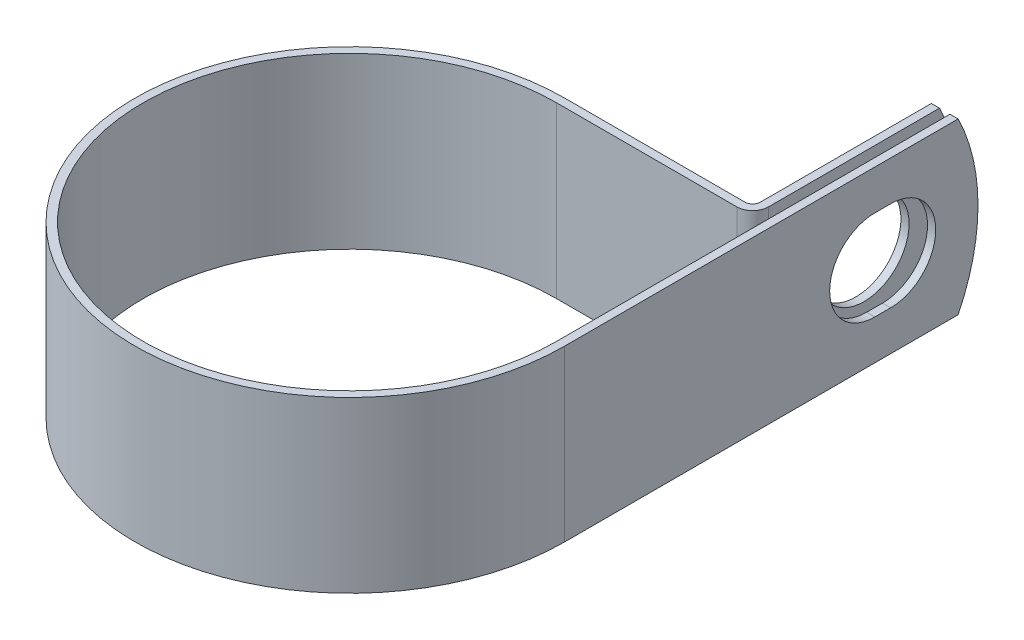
from build123d import *

# Parameters (mm, degrees)
EXTRUDE_THIN1_DEPTH = 12.7
SKETCH2_R           = 6.7437
CUT_EXTRUDE1_DEPTH  = 1.2192
CUT_EXTRUDE2_REACH  = 92.179
CUT_EXTRUDE3_DEPTH  = 88.361209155


with BuildPart() as part:
    # Sketch1 → Extrude-Thin1 (new, symmetric)
    with BuildSketch(Plane(origin=(0, 0, 0), x_dir=(1, 0, 0), z_dir=(0, 1, 0))):
        with BuildLine():
            Line((30.9499, 61.8998), (30.9499, 30.9499))
            Line((30.9499, 30.9499), (30.9499, 0))
            ThreePointArc((30.9499, 0), (-21.884884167, -21.884884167), (0, 30.9499))
            Line((0, 30.9499), (26.99766, 30.9499))
            ThreePointArc((26.99766, 30.9499), (28.678763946, 31.646236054), (29.3751, 33.32734))
            Line((29.3751, 33.32734), (29.3751, 61.8998))
            Line((29.3751, 61.8998), (28.1559, 61.8998))
            Line((28.1559, 61.8998), (28.1559, 33.32734))
            ThreePointArc((28.1559, 33.32734), (27.816659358, 32.508340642), (26.99766, 32.1691))
            Line((26.99766, 32.1691), (0, 32.1691))
            ThreePointArc((0, 32.1691), (-22.746988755, -22.746988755), (32.1691, 0))
            Line((32.1691, 0), (32.1691, 30.9499))
            Line((32.1691, 30.9499), (32.1691, 61.8998))
            Line((32.1691, 61.8998), (30.9499, 61.8998))
        make_face()
    extrude(amount=EXTRUDE_THIN1_DEPTH, both=True)

    # Sketch2 → Cut-Extrude1 (cut)
    with BuildSketch(Plane.ZY.offset(-28.1559)):
        with Locations((-47.625, 0)):
            Circle(SKETCH2_R)
    extrude(amount=-CUT_EXTRUDE1_DEPTH, mode=Mode.SUBTRACT)

    # Sketch3 → Cut-Extrude2 (cut, up to next)
    with BuildSketch(Plane(origin=(32.1691, 0, 0), x_dir=(0, 0, -1), z_dir=(1, 0, 0)), mode=Mode.PRIVATE) as cut_extrude2_sk1:
        with BuildLine():
            Line((46.4312, 6.7437), (48.8188, 6.7437))
            ThreePointArc((48.8188, 6.7437), (55.5625, 0), (48.8188, -6.7437))
            Line((48.8188, -6.7437), (46.4312, -6.7437))
            ThreePointArc((46.4312, -6.7437), (39.6875, 0), (46.4312, 6.7437))
        make_face()
    cut_extrude2_tool1 = extrude(cut_extrude2_sk1.sketch, amount=-CUT_EXTRUDE2_REACH, mode=Mode.PRIVATE) & part.part
    add(cut_extrude2_tool1.solids().sort_by_distance((32.1691, 0, -47.625))[0], mode=Mode.SUBTRACT)

    # Sketch4 → Cut-Extrude3 (cut, through all)
    with BuildSketch(Plane.ZY.offset(-28.1559)):
        with BuildLine():
            Line((-58.922468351, 12.7), (-61.8998, 12.7))
            Line((-61.8998, 12.7), (-61.8998, 0))
            ThreePointArc((-61.8998, 0), (-61.145511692, 6.522164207), (-58.922468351, 12.7))
        make_face()
        with BuildLine():
            ThreePointArc((-58.922468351, -12.7), (-61.145511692, -6.522164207), (-61.8998, 0))
            Line((-61.8998, 0), (-61.8998, -12.7))
            Line((-61.8998, -12.7), (-58.922468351, -12.7))
        make_face()
    extrude(amount=-CUT_EXTRUDE3_DEPTH, mode=Mode.SUBTRACT)


solid = part.part
